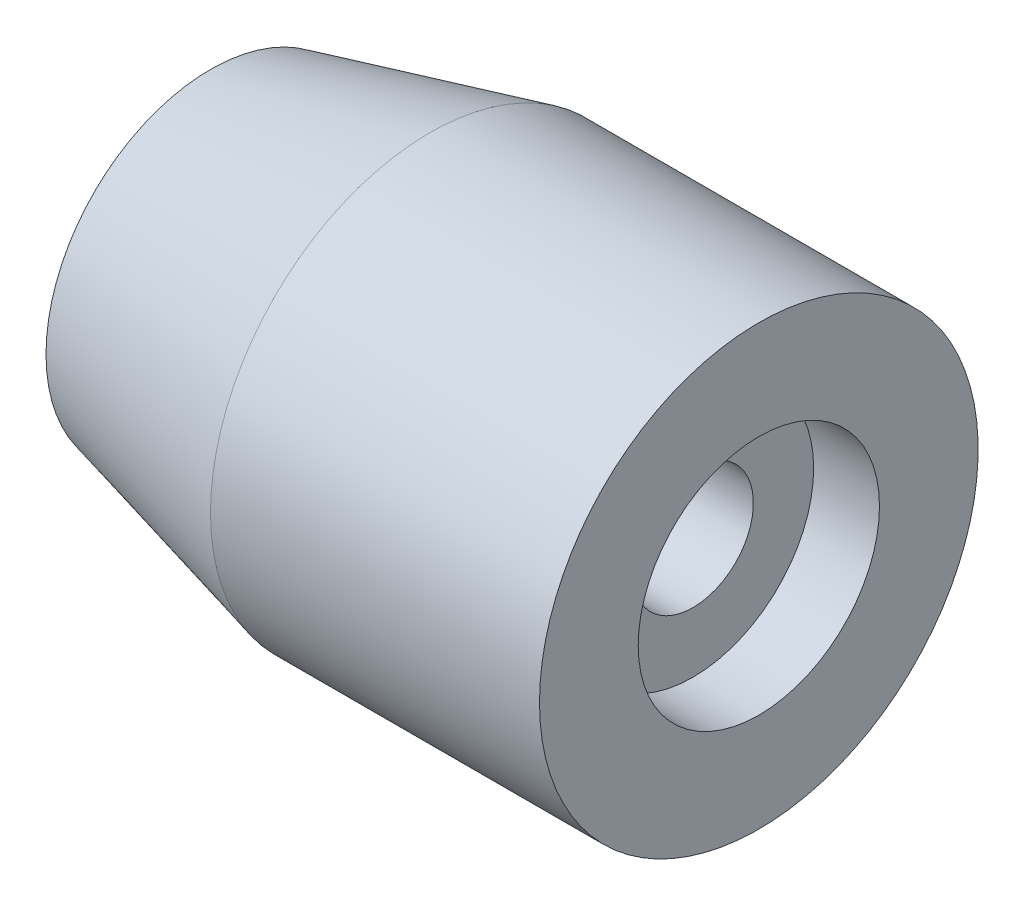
ISO-10303-21;
HEADER;
FILE_DESCRIPTION(('STEP AP214'),'2;1');
FILE_NAME('part.step','',(''),(''),'','','');
FILE_SCHEMA(('AUTOMOTIVE_DESIGN { 1 0 10303 214 1 1 1 1 }'));
ENDSEC;
DATA;
#1=APPLICATION_CONTEXT('core data for automotive mechanical design processes');
#2=APPLICATION_PROTOCOL_DEFINITION('international standard','automotive_design',2000,#1);
#3=PRODUCT_CONTEXT('',#1,'mechanical');
#4=PRODUCT('Part','Part','',(#3));
#5=PRODUCT_RELATED_PRODUCT_CATEGORY('part','',(#4));
#6=PRODUCT_DEFINITION_FORMATION('','',#4);
#7=PRODUCT_DEFINITION_CONTEXT('part definition',#1,'design');
#8=PRODUCT_DEFINITION('design','',#6,#7);
#9=PRODUCT_DEFINITION_SHAPE('','',#8);
#10=(LENGTH_UNIT() NAMED_UNIT(*) SI_UNIT(.MILLI.,.METRE.));
#11=(NAMED_UNIT(*) PLANE_ANGLE_UNIT() SI_UNIT($,.RADIAN.));
#12=(NAMED_UNIT(*) SI_UNIT($,.STERADIAN.) SOLID_ANGLE_UNIT());
#13=UNCERTAINTY_MEASURE_WITH_UNIT(LENGTH_MEASURE(1.E-05),#10,'distance_accuracy_value','');
#14=(GEOMETRIC_REPRESENTATION_CONTEXT(3) GLOBAL_UNCERTAINTY_ASSIGNED_CONTEXT((#13)) GLOBAL_UNIT_ASSIGNED_CONTEXT((#10,
#11,#12)) REPRESENTATION_CONTEXT('',''));
#15=CARTESIAN_POINT('',(0.,0.,0.));
#16=DIRECTION('',(0.,0.,1.));
#17=DIRECTION('',(1.,0.,0.));
#18=AXIS2_PLACEMENT_3D('',#15,#16,#17);
#19=CARTESIAN_POINT('',(-18.4128563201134,7.5,0.));
#20=DIRECTION('',(1.,0.,0.));
#21=DIRECTION('',(0.,0.,-1.));
#22=AXIS2_PLACEMENT_3D('',#19,#20,#21);
#23=PLANE('',#22);
#24=CARTESIAN_POINT('',(-18.4128563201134,0.,0.));
#25=DIRECTION('',(-1.,0.,0.));
#26=DIRECTION('',(0.,0.,1.));
#27=AXIS2_PLACEMENT_3D('',#24,#25,#26);
#28=CIRCLE('',#27,2.75);
#29=CARTESIAN_POINT('',(-18.4128563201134,0.,2.75));
#30=VERTEX_POINT('',#29);
#31=EDGE_CURVE('E10',#30,#30,#28,.T.);
#32=ORIENTED_EDGE('',*,*,#31,.F.);
#33=EDGE_LOOP('',(#32));
#34=FACE_BOUND('',#33,.T.);
#35=CARTESIAN_POINT('',(-18.4128563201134,0.,0.));
#36=DIRECTION('',(-1.,0.,0.));
#37=DIRECTION('',(0.,0.,1.));
#38=AXIS2_PLACEMENT_3D('',#35,#36,#37);
#39=CIRCLE('',#38,7.5);
#40=CARTESIAN_POINT('',(-18.4128563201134,0.,7.5));
#41=VERTEX_POINT('',#40);
#42=EDGE_CURVE('E56',#41,#41,#39,.T.);
#43=ORIENTED_EDGE('',*,*,#42,.T.);
#44=EDGE_LOOP('',(#43));
#45=FACE_BOUND('',#44,.T.);
#46=ADVANCED_FACE('F31',(#34,#45),#23,.F.);
#47=CARTESIAN_POINT('',(-7.01375318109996,0.,0.));
#48=DIRECTION('',(-1.,0.,0.));
#49=DIRECTION('',(0.,0.,1.));
#50=AXIS2_PLACEMENT_3D('',#47,#48,#49);
#51=CYLINDRICAL_SURFACE('',#50,2.75);
#52=CARTESIAN_POINT('',(3.58714367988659,0.,0.));
#53=DIRECTION('',(-1.,0.,0.));
#54=DIRECTION('',(0.,0.,1.));
#55=AXIS2_PLACEMENT_3D('',#52,#53,#54);
#56=CIRCLE('',#55,2.75);
#57=CARTESIAN_POINT('',(3.58714367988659,0.,2.75));
#58=VERTEX_POINT('',#57);
#59=EDGE_CURVE('E37',#58,#58,#56,.T.);
#60=ORIENTED_EDGE('',*,*,#59,.F.);
#61=EDGE_LOOP('',(#60));
#62=FACE_BOUND('',#61,.T.);
#63=ORIENTED_EDGE('',*,*,#31,.T.);
#64=EDGE_LOOP('',(#63));
#65=FACE_BOUND('',#64,.T.);
#66=ADVANCED_FACE('F87',(#62,#65),#51,.F.);
#67=CARTESIAN_POINT('',(3.58714367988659,2.75,0.));
#68=DIRECTION('',(-1.,0.,0.));
#69=DIRECTION('',(0.,0.,1.));
#70=AXIS2_PLACEMENT_3D('',#67,#68,#69);
#71=PLANE('',#70);
#72=CARTESIAN_POINT('',(3.58714367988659,0.,0.));
#73=DIRECTION('',(-1.,0.,0.));
#74=DIRECTION('',(0.,0.,1.));
#75=AXIS2_PLACEMENT_3D('',#72,#73,#74);
#76=CIRCLE('',#75,5.50000000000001);
#77=CARTESIAN_POINT('',(3.58714367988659,0.,5.50000000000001));
#78=VERTEX_POINT('',#77);
#79=EDGE_CURVE('E41',#78,#78,#76,.T.);
#80=ORIENTED_EDGE('',*,*,#79,.F.);
#81=EDGE_LOOP('',(#80));
#82=FACE_BOUND('',#81,.T.);
#83=ORIENTED_EDGE('',*,*,#59,.T.);
#84=EDGE_LOOP('',(#83));
#85=FACE_BOUND('',#84,.T.);
#86=ADVANCED_FACE('F82',(#82,#85),#71,.F.);
#87=CARTESIAN_POINT('',(-7.01375318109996,0.,0.));
#88=DIRECTION('',(-1.,0.,0.));
#89=DIRECTION('',(0.,0.,1.));
#90=AXIS2_PLACEMENT_3D('',#87,#88,#89);
#91=CYLINDRICAL_SURFACE('',#90,5.50000000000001);
#92=CARTESIAN_POINT('',(6.58714367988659,0.,0.));
#93=DIRECTION('',(-1.,0.,0.));
#94=DIRECTION('',(0.,0.,1.));
#95=AXIS2_PLACEMENT_3D('',#92,#93,#94);
#96=CIRCLE('',#95,5.50000000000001);
#97=CARTESIAN_POINT('',(6.58714367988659,0.,5.50000000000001));
#98=VERTEX_POINT('',#97);
#99=EDGE_CURVE('E45',#98,#98,#96,.T.);
#100=ORIENTED_EDGE('',*,*,#99,.F.);
#101=EDGE_LOOP('',(#100));
#102=FACE_BOUND('',#101,.T.);
#103=ORIENTED_EDGE('',*,*,#79,.T.);
#104=EDGE_LOOP('',(#103));
#105=FACE_BOUND('',#104,.T.);
#106=ADVANCED_FACE('F76',(#102,#105),#91,.F.);
#107=CARTESIAN_POINT('',(6.58714367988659,5.50000000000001,0.));
#108=DIRECTION('',(-1.,0.,0.));
#109=DIRECTION('',(0.,0.,1.));
#110=AXIS2_PLACEMENT_3D('',#107,#108,#109);
#111=PLANE('',#110);
#112=CARTESIAN_POINT('',(6.58714367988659,0.,0.));
#113=DIRECTION('',(-1.,0.,0.));
#114=DIRECTION('',(0.,0.,1.));
#115=AXIS2_PLACEMENT_3D('',#112,#113,#114);
#116=CIRCLE('',#115,10.);
#117=CARTESIAN_POINT('',(6.58714367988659,0.,10.));
#118=VERTEX_POINT('',#117);
#119=EDGE_CURVE('E50',#118,#118,#116,.T.);
#120=ORIENTED_EDGE('',*,*,#119,.F.);
#121=EDGE_LOOP('',(#120));
#122=FACE_BOUND('',#121,.T.);
#123=ORIENTED_EDGE('',*,*,#99,.T.);
#124=EDGE_LOOP('',(#123));
#125=FACE_BOUND('',#124,.T.);
#126=ADVANCED_FACE('F70',(#122,#125),#111,.F.);
#127=CARTESIAN_POINT('',(-7.01375318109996,0.,0.));
#128=DIRECTION('',(-1.,0.,0.));
#129=DIRECTION('',(0.,0.,1.));
#130=AXIS2_PLACEMENT_3D('',#127,#128,#129);
#131=CYLINDRICAL_SURFACE('',#130,10.);
#132=CARTESIAN_POINT('',(-8.41285632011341,0.,0.));
#133=DIRECTION('',(-1.,0.,0.));
#134=DIRECTION('',(0.,0.,1.));
#135=AXIS2_PLACEMENT_3D('',#132,#133,#134);
#136=CIRCLE('',#135,10.);
#137=CARTESIAN_POINT('',(-8.41285632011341,0.,10.));
#138=VERTEX_POINT('',#137);
#139=EDGE_CURVE('E53',#138,#138,#136,.T.);
#140=ORIENTED_EDGE('',*,*,#139,.F.);
#141=EDGE_LOOP('',(#140));
#142=FACE_BOUND('',#141,.T.);
#143=ORIENTED_EDGE('',*,*,#119,.T.);
#144=EDGE_LOOP('',(#143));
#145=FACE_BOUND('',#144,.T.);
#146=ADVANCED_FACE('F64',(#142,#145),#131,.T.);
#147=CARTESIAN_POINT('',(-8.41285632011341,0.,0.));
#148=DIRECTION('',(1.,0.,0.));
#149=DIRECTION('',(0.,0.,-1.));
#150=AXIS2_PLACEMENT_3D('',#147,#148,#149);
#151=CONICAL_SURFACE('',#150,10.,0.244978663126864);
#152=ORIENTED_EDGE('',*,*,#42,.F.);
#153=EDGE_LOOP('',(#152));
#154=FACE_BOUND('',#153,.T.);
#155=ORIENTED_EDGE('',*,*,#139,.T.);
#156=EDGE_LOOP('',(#155));
#157=FACE_BOUND('',#156,.T.);
#158=ADVANCED_FACE('F61',(#154,#157),#151,.T.);
#159=CLOSED_SHELL('',(#46,#66,#86,#106,#126,#146,#158));
#160=MANIFOLD_SOLID_BREP('B2',#159);
#161=ADVANCED_BREP_SHAPE_REPRESENTATION('',(#18,#160),#14);
#162=SHAPE_DEFINITION_REPRESENTATION(#9,#161);
ENDSEC;
END-ISO-10303-21;
